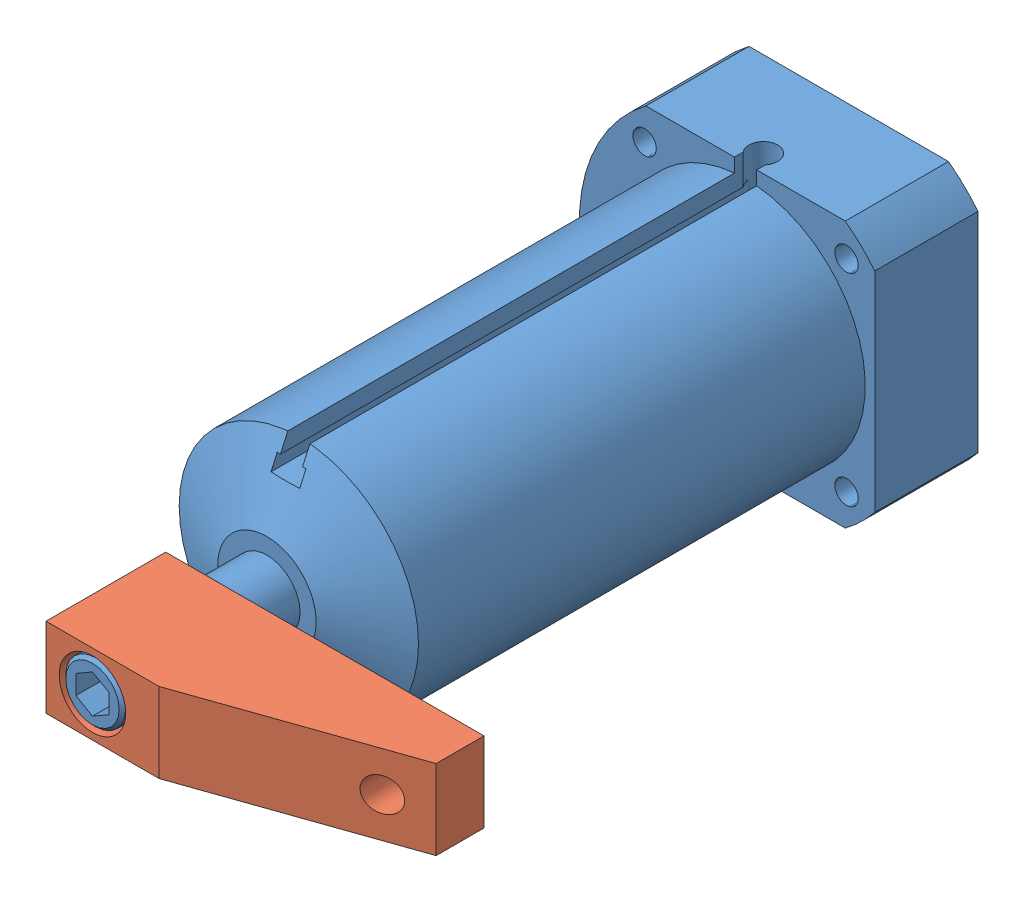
SolidWorks assembly ilcp1514100.sldasm, configuration Default (file format 4400). Lengths in mm.
Overall size (104.61 63.5 180.59).
2 component instances, 2 part files, 3 mates.
Components (placement in the parent):
- ilcp1514100-1: ilcp1514100.sldprt [Default] at origin size (70.55 63.5 180.59)
- ilc91501503-2: ilc91501503.SLDPRT [Default] at (-11.0998 -9.525 152.019) x (0 1 0) z (1 0 0) size (19.05 28.57 76.02)
Mates (geometry in assembly coordinates):
- Coincident1: coincident aligned: circle of ilcp1514100-1; plane of ilc91501503-2 through (64.9224 -9.525 152.019) normal (0 0 -1)
- Concentric1: concentric aligned: cone of ilcp1514100-1 through (0 0 152.019) axis (0 0 1); cone of ilc91501503-2 through (0 0 165.1254) axis (0 0 1)
- Parallel1: parallel aligned: plane of ilcp1514100-1 through (30.861 24.9539 138.938) normal (1 0 0); plane of ilc91501503-2 through (64.9224 -9.525 180.594) normal (1 0 0)
